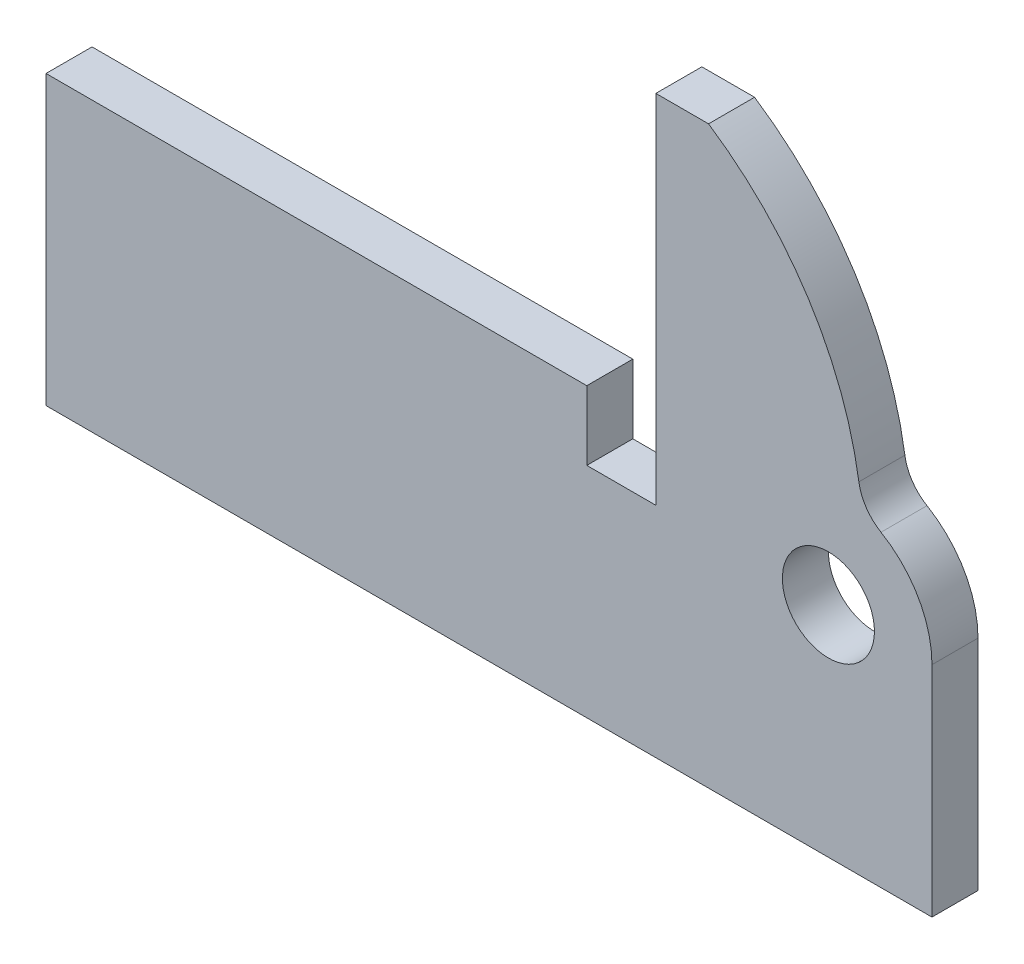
ISO-10303-21;
HEADER;
FILE_DESCRIPTION(('STEP AP214'),'2;1');
FILE_NAME('part.step','',(''),(''),'','','');
FILE_SCHEMA(('AUTOMOTIVE_DESIGN { 1 0 10303 214 1 1 1 1 }'));
ENDSEC;
DATA;
#1=APPLICATION_CONTEXT('core data for automotive mechanical design processes');
#2=APPLICATION_PROTOCOL_DEFINITION('international standard','automotive_design',2000,#1);
#3=PRODUCT_CONTEXT('',#1,'mechanical');
#4=PRODUCT('Part','Part','',(#3));
#5=PRODUCT_RELATED_PRODUCT_CATEGORY('part','',(#4));
#6=PRODUCT_DEFINITION_FORMATION('','',#4);
#7=PRODUCT_DEFINITION_CONTEXT('part definition',#1,'design');
#8=PRODUCT_DEFINITION('design','',#6,#7);
#9=PRODUCT_DEFINITION_SHAPE('','',#8);
#10=(LENGTH_UNIT() NAMED_UNIT(*) SI_UNIT(.MILLI.,.METRE.));
#11=(NAMED_UNIT(*) PLANE_ANGLE_UNIT() SI_UNIT($,.RADIAN.));
#12=(NAMED_UNIT(*) SI_UNIT($,.STERADIAN.) SOLID_ANGLE_UNIT());
#13=UNCERTAINTY_MEASURE_WITH_UNIT(LENGTH_MEASURE(1.E-05),#10,'distance_accuracy_value','');
#14=(GEOMETRIC_REPRESENTATION_CONTEXT(3) GLOBAL_UNCERTAINTY_ASSIGNED_CONTEXT((#13)) GLOBAL_UNIT_ASSIGNED_CONTEXT((#10,
#11,#12)) REPRESENTATION_CONTEXT('',''));
#15=CARTESIAN_POINT('',(0.,0.,0.));
#16=DIRECTION('',(0.,0.,1.));
#17=DIRECTION('',(1.,0.,0.));
#18=AXIS2_PLACEMENT_3D('',#15,#16,#17);
#19=CARTESIAN_POINT('',(41.,25.,4.));
#20=DIRECTION('',(0.,0.,1.));
#21=DIRECTION('',(1.,0.,0.));
#22=AXIS2_PLACEMENT_3D('',#19,#20,#21);
#23=PLANE('',#22);
#24=DIRECTION('',(0.,-1.,0.));
#25=VECTOR('',#24,1.);
#26=CARTESIAN_POINT('',(0.,0.,4.));
#27=LINE('',#26,#25);
#28=CARTESIAN_POINT('',(0.,25.,4.));
#29=VERTEX_POINT('',#28);
#30=CARTESIAN_POINT('',(0.,0.,4.));
#31=VERTEX_POINT('',#30);
#32=EDGE_CURVE('E168',#29,#31,#27,.T.);
#33=ORIENTED_EDGE('',*,*,#32,.T.);
#34=DIRECTION('',(1.,0.,0.));
#35=VECTOR('',#34,1.);
#36=CARTESIAN_POINT('',(0.,0.,4.));
#37=LINE('',#36,#35);
#38=CARTESIAN_POINT('',(77.,0.,4.));
#39=VERTEX_POINT('',#38);
#40=EDGE_CURVE('E101',#31,#39,#37,.T.);
#41=ORIENTED_EDGE('',*,*,#40,.T.);
#42=DIRECTION('',(0.,1.,0.));
#43=VECTOR('',#42,1.);
#44=CARTESIAN_POINT('',(77.,0.,4.));
#45=LINE('',#44,#43);
#46=CARTESIAN_POINT('',(77.,19.,4.));
#47=VERTEX_POINT('',#46);
#48=EDGE_CURVE('E192',#39,#47,#45,.T.);
#49=ORIENTED_EDGE('',*,*,#48,.T.);
#50=CARTESIAN_POINT('',(68.,19.,4.));
#51=DIRECTION('',(0.,0.,1.));
#52=DIRECTION('',(1.,0.,0.));
#53=AXIS2_PLACEMENT_3D('',#50,#51,#52);
#54=CIRCLE('',#53,9.);
#55=CARTESIAN_POINT('',(72.5692307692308,26.7538461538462,4.));
#56=VERTEX_POINT('',#55);
#57=EDGE_CURVE('E211',#47,#56,#54,.T.);
#58=ORIENTED_EDGE('',*,*,#57,.T.);
#59=CARTESIAN_POINT('',(74.6,30.2,4.));
#60=DIRECTION('',(0.,0.,-1.));
#61=DIRECTION('',(1.,0.,0.));
#62=AXIS2_PLACEMENT_3D('',#59,#60,#61);
#63=CIRCLE('',#62,3.99999999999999);
#64=CARTESIAN_POINT('',(70.6470588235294,29.5882352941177,4.));
#65=VERTEX_POINT('',#64);
#66=EDGE_CURVE('E208',#56,#65,#63,.T.);
#67=ORIENTED_EDGE('',*,*,#66,.T.);
#68=CARTESIAN_POINT('',(41.,25.,4.));
#69=DIRECTION('',(0.,0.,1.));
#70=DIRECTION('',(1.,0.,0.));
#71=AXIS2_PLACEMENT_3D('',#68,#69,#70);
#72=CIRCLE('',#71,30.);
#73=CARTESIAN_POINT('',(57.583123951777,50.,4.));
#74=VERTEX_POINT('',#73);
#75=EDGE_CURVE('E210',#65,#74,#72,.T.);
#76=ORIENTED_EDGE('',*,*,#75,.T.);
#77=DIRECTION('',(-1.,0.,0.));
#78=VECTOR('',#77,1.);
#79=CARTESIAN_POINT('',(53.,50.,4.));
#80=LINE('',#79,#78);
#81=CARTESIAN_POINT('',(53.,50.,4.));
#82=VERTEX_POINT('',#81);
#83=EDGE_CURVE('E213',#74,#82,#80,.T.);
#84=ORIENTED_EDGE('',*,*,#83,.T.);
#85=DIRECTION('',(0.,-1.,0.));
#86=VECTOR('',#85,1.);
#87=CARTESIAN_POINT('',(53.,19.,4.));
#88=LINE('',#87,#86);
#89=CARTESIAN_POINT('',(53.,19.,4.));
#90=VERTEX_POINT('',#89);
#91=EDGE_CURVE('E129',#82,#90,#88,.T.);
#92=ORIENTED_EDGE('',*,*,#91,.T.);
#93=DIRECTION('',(-1.,0.,0.));
#94=VECTOR('',#93,1.);
#95=CARTESIAN_POINT('',(47.,19.,4.));
#96=LINE('',#95,#94);
#97=CARTESIAN_POINT('',(47.,19.,4.));
#98=VERTEX_POINT('',#97);
#99=EDGE_CURVE('E123',#90,#98,#96,.T.);
#100=ORIENTED_EDGE('',*,*,#99,.T.);
#101=DIRECTION('',(0.,1.,0.));
#102=VECTOR('',#101,1.);
#103=CARTESIAN_POINT('',(47.,25.,4.));
#104=LINE('',#103,#102);
#105=CARTESIAN_POINT('',(47.,25.,4.));
#106=VERTEX_POINT('',#105);
#107=EDGE_CURVE('E127',#98,#106,#104,.T.);
#108=ORIENTED_EDGE('',*,*,#107,.T.);
#109=DIRECTION('',(-1.,0.,0.));
#110=VECTOR('',#109,1.);
#111=CARTESIAN_POINT('',(0.,25.,4.));
#112=LINE('',#111,#110);
#113=EDGE_CURVE('E49',#106,#29,#112,.T.);
#114=ORIENTED_EDGE('',*,*,#113,.T.);
#115=EDGE_LOOP('',(#33,#41,#49,#58,#67,#76,#84,#92,#100,#108,#114));
#116=FACE_BOUND('',#115,.T.);
#117=CARTESIAN_POINT('',(68.,19.,4.));
#118=DIRECTION('',(0.,0.,1.));
#119=DIRECTION('',(1.,0.,0.));
#120=AXIS2_PLACEMENT_3D('',#117,#118,#119);
#121=CIRCLE('',#120,4.00000000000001);
#122=CARTESIAN_POINT('',(72.,19.,4.));
#123=VERTEX_POINT('',#122);
#124=EDGE_CURVE('E151',#123,#123,#121,.T.);
#125=ORIENTED_EDGE('',*,*,#124,.F.);
#126=EDGE_LOOP('',(#125));
#127=FACE_BOUND('',#126,.T.);
#128=ADVANCED_FACE('F32',(#116,#127),#23,.T.);
#129=CARTESIAN_POINT('',(41.,25.,0.));
#130=DIRECTION('',(0.,0.,1.));
#131=DIRECTION('',(1.,0.,0.));
#132=AXIS2_PLACEMENT_3D('',#129,#130,#131);
#133=PLANE('',#132);
#134=DIRECTION('',(0.,-1.,0.));
#135=VECTOR('',#134,1.);
#136=CARTESIAN_POINT('',(0.,0.,0.));
#137=LINE('',#136,#135);
#138=CARTESIAN_POINT('',(0.,25.,0.));
#139=VERTEX_POINT('',#138);
#140=CARTESIAN_POINT('',(0.,0.,0.));
#141=VERTEX_POINT('',#140);
#142=EDGE_CURVE('E147',#139,#141,#137,.T.);
#143=ORIENTED_EDGE('',*,*,#142,.F.);
#144=DIRECTION('',(-1.,0.,0.));
#145=VECTOR('',#144,1.);
#146=CARTESIAN_POINT('',(0.,25.,0.));
#147=LINE('',#146,#145);
#148=CARTESIAN_POINT('',(47.,25.,0.));
#149=VERTEX_POINT('',#148);
#150=EDGE_CURVE('E93',#149,#139,#147,.T.);
#151=ORIENTED_EDGE('',*,*,#150,.F.);
#152=DIRECTION('',(0.,1.,0.));
#153=VECTOR('',#152,1.);
#154=CARTESIAN_POINT('',(47.,25.,0.));
#155=LINE('',#154,#153);
#156=CARTESIAN_POINT('',(47.,19.,0.));
#157=VERTEX_POINT('',#156);
#158=EDGE_CURVE('E87',#157,#149,#155,.T.);
#159=ORIENTED_EDGE('',*,*,#158,.F.);
#160=DIRECTION('',(-1.,0.,0.));
#161=VECTOR('',#160,1.);
#162=CARTESIAN_POINT('',(47.,19.,0.));
#163=LINE('',#162,#161);
#164=CARTESIAN_POINT('',(53.,19.,0.));
#165=VERTEX_POINT('',#164);
#166=EDGE_CURVE('E137',#165,#157,#163,.T.);
#167=ORIENTED_EDGE('',*,*,#166,.F.);
#168=DIRECTION('',(0.,-1.,0.));
#169=VECTOR('',#168,1.);
#170=CARTESIAN_POINT('',(53.,19.,0.));
#171=LINE('',#170,#169);
#172=CARTESIAN_POINT('',(53.,50.,0.));
#173=VERTEX_POINT('',#172);
#174=EDGE_CURVE('E163',#173,#165,#171,.T.);
#175=ORIENTED_EDGE('',*,*,#174,.F.);
#176=DIRECTION('',(-1.,0.,0.));
#177=VECTOR('',#176,1.);
#178=CARTESIAN_POINT('',(53.,50.,0.));
#179=LINE('',#178,#177);
#180=CARTESIAN_POINT('',(57.583123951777,50.,0.));
#181=VERTEX_POINT('',#180);
#182=EDGE_CURVE('E161',#181,#173,#179,.T.);
#183=ORIENTED_EDGE('',*,*,#182,.F.);
#184=CARTESIAN_POINT('',(41.,25.,0.));
#185=DIRECTION('',(0.,0.,1.));
#186=DIRECTION('',(1.,0.,0.));
#187=AXIS2_PLACEMENT_3D('',#184,#185,#186);
#188=CIRCLE('',#187,30.);
#189=CARTESIAN_POINT('',(70.6470588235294,29.5882352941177,0.));
#190=VERTEX_POINT('',#189);
#191=EDGE_CURVE('E159',#190,#181,#188,.T.);
#192=ORIENTED_EDGE('',*,*,#191,.F.);
#193=CARTESIAN_POINT('',(74.6,30.2,0.));
#194=DIRECTION('',(0.,0.,-1.));
#195=DIRECTION('',(1.,0.,0.));
#196=AXIS2_PLACEMENT_3D('',#193,#194,#195);
#197=CIRCLE('',#196,3.99999999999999);
#198=CARTESIAN_POINT('',(72.5692307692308,26.7538461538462,0.));
#199=VERTEX_POINT('',#198);
#200=EDGE_CURVE('E157',#199,#190,#197,.T.);
#201=ORIENTED_EDGE('',*,*,#200,.F.);
#202=CARTESIAN_POINT('',(68.,19.,0.));
#203=DIRECTION('',(0.,0.,1.));
#204=DIRECTION('',(1.,0.,0.));
#205=AXIS2_PLACEMENT_3D('',#202,#203,#204);
#206=CIRCLE('',#205,9.);
#207=CARTESIAN_POINT('',(77.,19.,0.));
#208=VERTEX_POINT('',#207);
#209=EDGE_CURVE('E155',#208,#199,#206,.T.);
#210=ORIENTED_EDGE('',*,*,#209,.F.);
#211=DIRECTION('',(0.,1.,0.));
#212=VECTOR('',#211,1.);
#213=CARTESIAN_POINT('',(77.,0.,0.));
#214=LINE('',#213,#212);
#215=CARTESIAN_POINT('',(77.,0.,0.));
#216=VERTEX_POINT('',#215);
#217=EDGE_CURVE('E153',#216,#208,#214,.T.);
#218=ORIENTED_EDGE('',*,*,#217,.F.);
#219=DIRECTION('',(1.,0.,0.));
#220=VECTOR('',#219,1.);
#221=CARTESIAN_POINT('',(0.,0.,0.));
#222=LINE('',#221,#220);
#223=EDGE_CURVE('E150',#141,#216,#222,.T.);
#224=ORIENTED_EDGE('',*,*,#223,.F.);
#225=EDGE_LOOP('',(#143,#151,#159,#167,#175,#183,#192,#201,#210,#218,#224));
#226=FACE_BOUND('',#225,.T.);
#227=CARTESIAN_POINT('',(68.,19.,0.));
#228=DIRECTION('',(0.,0.,1.));
#229=DIRECTION('',(1.,0.,0.));
#230=AXIS2_PLACEMENT_3D('',#227,#228,#229);
#231=CIRCLE('',#230,4.00000000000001);
#232=CARTESIAN_POINT('',(72.,19.,0.));
#233=VERTEX_POINT('',#232);
#234=EDGE_CURVE('E351',#233,#233,#231,.T.);
#235=ORIENTED_EDGE('',*,*,#234,.T.);
#236=EDGE_LOOP('',(#235));
#237=FACE_BOUND('',#236,.T.);
#238=ADVANCED_FACE('F196',(#226,#237),#133,.F.);
#239=CARTESIAN_POINT('',(0.,0.,4.));
#240=DIRECTION('',(1.,0.,0.));
#241=DIRECTION('',(0.,0.,-1.));
#242=AXIS2_PLACEMENT_3D('',#239,#240,#241);
#243=PLANE('',#242);
#244=ORIENTED_EDGE('',*,*,#142,.T.);
#245=DIRECTION('',(0.,0.,-1.));
#246=VECTOR('',#245,1.);
#247=CARTESIAN_POINT('',(0.,0.,4.));
#248=LINE('',#247,#246);
#249=EDGE_CURVE('E11',#31,#141,#248,.T.);
#250=ORIENTED_EDGE('',*,*,#249,.F.);
#251=ORIENTED_EDGE('',*,*,#32,.F.);
#252=DIRECTION('',(0.,0.,-1.));
#253=VECTOR('',#252,1.);
#254=CARTESIAN_POINT('',(0.,25.,4.));
#255=LINE('',#254,#253);
#256=EDGE_CURVE('E143',#29,#139,#255,.T.);
#257=ORIENTED_EDGE('',*,*,#256,.T.);
#258=EDGE_LOOP('',(#244,#250,#251,#257));
#259=FACE_BOUND('',#258,.T.);
#260=ADVANCED_FACE('F34',(#259),#243,.F.);
#261=CARTESIAN_POINT('',(0.,0.,4.));
#262=DIRECTION('',(0.,1.,0.));
#263=DIRECTION('',(0.,0.,1.));
#264=AXIS2_PLACEMENT_3D('',#261,#262,#263);
#265=PLANE('',#264);
#266=ORIENTED_EDGE('',*,*,#223,.T.);
#267=DIRECTION('',(0.,0.,-1.));
#268=VECTOR('',#267,1.);
#269=CARTESIAN_POINT('',(77.,0.,4.));
#270=LINE('',#269,#268);
#271=EDGE_CURVE('E41',#39,#216,#270,.T.);
#272=ORIENTED_EDGE('',*,*,#271,.F.);
#273=ORIENTED_EDGE('',*,*,#40,.F.);
#274=ORIENTED_EDGE('',*,*,#249,.T.);
#275=EDGE_LOOP('',(#266,#272,#273,#274));
#276=FACE_BOUND('',#275,.T.);
#277=ADVANCED_FACE('F250',(#276),#265,.F.);
#278=CARTESIAN_POINT('',(77.,0.,4.));
#279=DIRECTION('',(-1.,0.,0.));
#280=DIRECTION('',(0.,0.,1.));
#281=AXIS2_PLACEMENT_3D('',#278,#279,#280);
#282=PLANE('',#281);
#283=ORIENTED_EDGE('',*,*,#217,.T.);
#284=DIRECTION('',(0.,0.,-1.));
#285=VECTOR('',#284,1.);
#286=CARTESIAN_POINT('',(77.,19.,4.));
#287=LINE('',#286,#285);
#288=EDGE_CURVE('E184',#47,#208,#287,.T.);
#289=ORIENTED_EDGE('',*,*,#288,.F.);
#290=ORIENTED_EDGE('',*,*,#48,.F.);
#291=ORIENTED_EDGE('',*,*,#271,.T.);
#292=EDGE_LOOP('',(#283,#289,#290,#291));
#293=FACE_BOUND('',#292,.T.);
#294=ADVANCED_FACE('F190',(#293),#282,.F.);
#295=CARTESIAN_POINT('',(68.,19.,4.));
#296=DIRECTION('',(0.,0.,-1.));
#297=DIRECTION('',(-1.,0.,0.));
#298=AXIS2_PLACEMENT_3D('',#295,#296,#297);
#299=CYLINDRICAL_SURFACE('',#298,9.);
#300=ORIENTED_EDGE('',*,*,#209,.T.);
#301=DIRECTION('',(0.,0.,-1.));
#302=VECTOR('',#301,1.);
#303=CARTESIAN_POINT('',(72.5692307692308,26.7538461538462,4.));
#304=LINE('',#303,#302);
#305=EDGE_CURVE('E181',#56,#199,#304,.T.);
#306=ORIENTED_EDGE('',*,*,#305,.F.);
#307=ORIENTED_EDGE('',*,*,#57,.F.);
#308=ORIENTED_EDGE('',*,*,#288,.T.);
#309=EDGE_LOOP('',(#300,#306,#307,#308));
#310=FACE_BOUND('',#309,.T.);
#311=ADVANCED_FACE('F202',(#310),#299,.T.);
#312=CARTESIAN_POINT('',(74.6,30.2,4.));
#313=DIRECTION('',(0.,0.,-1.));
#314=DIRECTION('',(-1.,0.,0.));
#315=AXIS2_PLACEMENT_3D('',#312,#313,#314);
#316=CYLINDRICAL_SURFACE('',#315,3.99999999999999);
#317=ORIENTED_EDGE('',*,*,#200,.T.);
#318=DIRECTION('',(0.,0.,-1.));
#319=VECTOR('',#318,1.);
#320=CARTESIAN_POINT('',(70.6470588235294,29.5882352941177,4.));
#321=LINE('',#320,#319);
#322=EDGE_CURVE('E178',#65,#190,#321,.T.);
#323=ORIENTED_EDGE('',*,*,#322,.F.);
#324=ORIENTED_EDGE('',*,*,#66,.F.);
#325=ORIENTED_EDGE('',*,*,#305,.T.);
#326=EDGE_LOOP('',(#317,#323,#324,#325));
#327=FACE_BOUND('',#326,.T.);
#328=ADVANCED_FACE('F206',(#327),#316,.F.);
#329=CARTESIAN_POINT('',(41.,25.,4.));
#330=DIRECTION('',(0.,0.,-1.));
#331=DIRECTION('',(-1.,0.,0.));
#332=AXIS2_PLACEMENT_3D('',#329,#330,#331);
#333=CYLINDRICAL_SURFACE('',#332,30.);
#334=ORIENTED_EDGE('',*,*,#191,.T.);
#335=DIRECTION('',(0.,0.,-1.));
#336=VECTOR('',#335,1.);
#337=CARTESIAN_POINT('',(57.583123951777,50.,4.));
#338=LINE('',#337,#336);
#339=EDGE_CURVE('E175',#74,#181,#338,.T.);
#340=ORIENTED_EDGE('',*,*,#339,.F.);
#341=ORIENTED_EDGE('',*,*,#75,.F.);
#342=ORIENTED_EDGE('',*,*,#322,.T.);
#343=EDGE_LOOP('',(#334,#340,#341,#342));
#344=FACE_BOUND('',#343,.T.);
#345=ADVANCED_FACE('F263',(#344),#333,.T.);
#346=CARTESIAN_POINT('',(53.,50.,4.));
#347=DIRECTION('',(0.,-1.,0.));
#348=DIRECTION('',(0.,0.,-1.));
#349=AXIS2_PLACEMENT_3D('',#346,#347,#348);
#350=PLANE('',#349);
#351=ORIENTED_EDGE('',*,*,#182,.T.);
#352=DIRECTION('',(0.,0.,-1.));
#353=VECTOR('',#352,1.);
#354=CARTESIAN_POINT('',(53.,50.,4.));
#355=LINE('',#354,#353);
#356=EDGE_CURVE('E172',#82,#173,#355,.T.);
#357=ORIENTED_EDGE('',*,*,#356,.F.);
#358=ORIENTED_EDGE('',*,*,#83,.F.);
#359=ORIENTED_EDGE('',*,*,#339,.T.);
#360=EDGE_LOOP('',(#351,#357,#358,#359));
#361=FACE_BOUND('',#360,.T.);
#362=ADVANCED_FACE('F222',(#361),#350,.F.);
#363=CARTESIAN_POINT('',(53.,19.,4.));
#364=DIRECTION('',(1.,0.,0.));
#365=DIRECTION('',(0.,0.,-1.));
#366=AXIS2_PLACEMENT_3D('',#363,#364,#365);
#367=PLANE('',#366);
#368=ORIENTED_EDGE('',*,*,#174,.T.);
#369=DIRECTION('',(0.,0.,-1.));
#370=VECTOR('',#369,1.);
#371=CARTESIAN_POINT('',(53.,19.,4.));
#372=LINE('',#371,#370);
#373=EDGE_CURVE('E138',#90,#165,#372,.T.);
#374=ORIENTED_EDGE('',*,*,#373,.F.);
#375=ORIENTED_EDGE('',*,*,#91,.F.);
#376=ORIENTED_EDGE('',*,*,#356,.T.);
#377=EDGE_LOOP('',(#368,#374,#375,#376));
#378=FACE_BOUND('',#377,.T.);
#379=ADVANCED_FACE('F226',(#378),#367,.F.);
#380=CARTESIAN_POINT('',(47.,19.,4.));
#381=DIRECTION('',(0.,-1.,0.));
#382=DIRECTION('',(0.,0.,-1.));
#383=AXIS2_PLACEMENT_3D('',#380,#381,#382);
#384=PLANE('',#383);
#385=ORIENTED_EDGE('',*,*,#166,.T.);
#386=DIRECTION('',(0.,0.,-1.));
#387=VECTOR('',#386,1.);
#388=CARTESIAN_POINT('',(47.,19.,4.));
#389=LINE('',#388,#387);
#390=EDGE_CURVE('E134',#98,#157,#389,.T.);
#391=ORIENTED_EDGE('',*,*,#390,.F.);
#392=ORIENTED_EDGE('',*,*,#99,.F.);
#393=ORIENTED_EDGE('',*,*,#373,.T.);
#394=EDGE_LOOP('',(#385,#391,#392,#393));
#395=FACE_BOUND('',#394,.T.);
#396=ADVANCED_FACE('F135',(#395),#384,.F.);
#397=CARTESIAN_POINT('',(47.,25.,4.));
#398=DIRECTION('',(-1.,0.,0.));
#399=DIRECTION('',(0.,0.,1.));
#400=AXIS2_PLACEMENT_3D('',#397,#398,#399);
#401=PLANE('',#400);
#402=ORIENTED_EDGE('',*,*,#158,.T.);
#403=DIRECTION('',(0.,0.,-1.));
#404=VECTOR('',#403,1.);
#405=CARTESIAN_POINT('',(47.,25.,4.));
#406=LINE('',#405,#404);
#407=EDGE_CURVE('E139',#106,#149,#406,.T.);
#408=ORIENTED_EDGE('',*,*,#407,.F.);
#409=ORIENTED_EDGE('',*,*,#107,.F.);
#410=ORIENTED_EDGE('',*,*,#390,.T.);
#411=EDGE_LOOP('',(#402,#408,#409,#410));
#412=FACE_BOUND('',#411,.T.);
#413=ADVANCED_FACE('F141',(#412),#401,.F.);
#414=CARTESIAN_POINT('',(0.,25.,4.));
#415=DIRECTION('',(0.,-1.,0.));
#416=DIRECTION('',(1.,0.,0.));
#417=AXIS2_PLACEMENT_3D('',#414,#415,#416);
#418=PLANE('',#417);
#419=ORIENTED_EDGE('',*,*,#150,.T.);
#420=ORIENTED_EDGE('',*,*,#256,.F.);
#421=ORIENTED_EDGE('',*,*,#113,.F.);
#422=ORIENTED_EDGE('',*,*,#407,.T.);
#423=EDGE_LOOP('',(#419,#420,#421,#422));
#424=FACE_BOUND('',#423,.T.);
#425=ADVANCED_FACE('F230',(#424),#418,.F.);
#426=CARTESIAN_POINT('',(68.,19.,4.));
#427=DIRECTION('',(0.,0.,-1.));
#428=DIRECTION('',(-1.,0.,0.));
#429=AXIS2_PLACEMENT_3D('',#426,#427,#428);
#430=CYLINDRICAL_SURFACE('',#429,4.00000000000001);
#431=ORIENTED_EDGE('',*,*,#124,.T.);
#432=EDGE_LOOP('',(#431));
#433=FACE_BOUND('',#432,.T.);
#434=ORIENTED_EDGE('',*,*,#234,.F.);
#435=EDGE_LOOP('',(#434));
#436=FACE_BOUND('',#435,.T.);
#437=ADVANCED_FACE('F232',(#433,#436),#430,.F.);
#438=CLOSED_SHELL('',(#128,#238,#260,#277,#294,#311,#328,#345,#362,#379,#396,#413,#425,#437));
#439=MANIFOLD_SOLID_BREP('B2',#438);
#440=ADVANCED_BREP_SHAPE_REPRESENTATION('',(#18,#439),#14);
#441=SHAPE_DEFINITION_REPRESENTATION(#9,#440);
ENDSEC;
END-ISO-10303-21;
